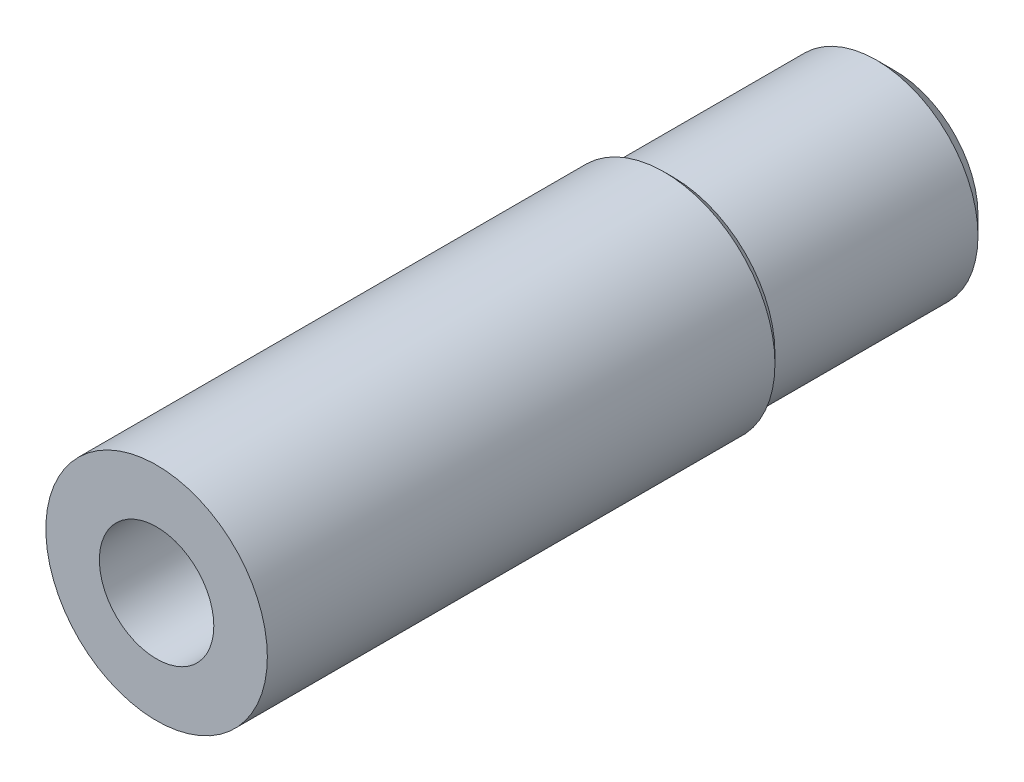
ISO-10303-21;
HEADER;
FILE_DESCRIPTION(('STEP AP214'),'2;1');
FILE_NAME('part.step','',(''),(''),'','','');
FILE_SCHEMA(('AUTOMOTIVE_DESIGN { 1 0 10303 214 1 1 1 1 }'));
ENDSEC;
DATA;
#1=APPLICATION_CONTEXT('core data for automotive mechanical design processes');
#2=APPLICATION_PROTOCOL_DEFINITION('international standard','automotive_design',2000,#1);
#3=PRODUCT_CONTEXT('',#1,'mechanical');
#4=PRODUCT('Part','Part','',(#3));
#5=PRODUCT_RELATED_PRODUCT_CATEGORY('part','',(#4));
#6=PRODUCT_DEFINITION_FORMATION('','',#4);
#7=PRODUCT_DEFINITION_CONTEXT('part definition',#1,'design');
#8=PRODUCT_DEFINITION('design','',#6,#7);
#9=PRODUCT_DEFINITION_SHAPE('','',#8);
#10=(LENGTH_UNIT() NAMED_UNIT(*) SI_UNIT(.MILLI.,.METRE.));
#11=(NAMED_UNIT(*) PLANE_ANGLE_UNIT() SI_UNIT($,.RADIAN.));
#12=(NAMED_UNIT(*) SI_UNIT($,.STERADIAN.) SOLID_ANGLE_UNIT());
#13=UNCERTAINTY_MEASURE_WITH_UNIT(LENGTH_MEASURE(1.E-05),#10,'distance_accuracy_value','');
#14=(GEOMETRIC_REPRESENTATION_CONTEXT(3) GLOBAL_UNCERTAINTY_ASSIGNED_CONTEXT((#13)) GLOBAL_UNIT_ASSIGNED_CONTEXT((#10,
#11,#12)) REPRESENTATION_CONTEXT('',''));
#15=CARTESIAN_POINT('',(0.,0.,0.));
#16=DIRECTION('',(0.,0.,1.));
#17=DIRECTION('',(1.,0.,0.));
#18=AXIS2_PLACEMENT_3D('',#15,#16,#17);
#19=CARTESIAN_POINT('',(1.00000000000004,0.,-13.));
#20=DIRECTION('',(0.,0.,-1.));
#21=DIRECTION('',(-1.,0.,0.));
#22=AXIS2_PLACEMENT_3D('',#19,#20,#21);
#23=PLANE('',#22);
#24=CARTESIAN_POINT('',(0.,0.,-13.));
#25=DIRECTION('',(0.,0.,1.));
#26=DIRECTION('',(1.,0.,0.));
#27=AXIS2_PLACEMENT_3D('',#24,#25,#26);
#28=CIRCLE('',#27,0.800799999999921);
#29=CARTESIAN_POINT('',(0.800800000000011,0.,-13.));
#30=VERTEX_POINT('',#29);
#31=EDGE_CURVE('E54',#30,#30,#28,.T.);
#32=ORIENTED_EDGE('',*,*,#31,.T.);
#33=EDGE_LOOP('',(#32));
#34=FACE_BOUND('',#33,.T.);
#35=CARTESIAN_POINT('',(0.,0.,-13.));
#36=DIRECTION('',(0.,0.,1.));
#37=DIRECTION('',(1.,0.,0.));
#38=AXIS2_PLACEMENT_3D('',#35,#36,#37);
#39=CIRCLE('',#38,1.24999999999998);
#40=CARTESIAN_POINT('',(1.25000000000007,0.,-13.));
#41=VERTEX_POINT('',#40);
#42=EDGE_CURVE('E17',#41,#41,#39,.F.);
#43=ORIENTED_EDGE('',*,*,#42,.T.);
#44=EDGE_LOOP('',(#43));
#45=FACE_BOUND('',#44,.T.);
#46=ADVANCED_FACE('F14',(#34,#45),#23,.T.);
#47=CARTESIAN_POINT('',(0.,0.,-16.5));
#48=DIRECTION('',(0.,0.,1.));
#49=DIRECTION('',(1.,0.,0.));
#50=AXIS2_PLACEMENT_3D('',#47,#48,#49);
#51=CYLINDRICAL_SURFACE('',#50,1.24999999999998);
#52=CARTESIAN_POINT('',(0.,0.,-20.));
#53=DIRECTION('',(0.,0.,1.));
#54=DIRECTION('',(1.,0.,0.));
#55=AXIS2_PLACEMENT_3D('',#52,#53,#54);
#56=CIRCLE('',#55,1.24999999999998);
#57=CARTESIAN_POINT('',(1.25000000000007,0.,-20.));
#58=VERTEX_POINT('',#57);
#59=EDGE_CURVE('E52',#58,#58,#56,.T.);
#60=ORIENTED_EDGE('',*,*,#59,.F.);
#61=EDGE_LOOP('',(#60));
#62=FACE_BOUND('',#61,.T.);
#63=ORIENTED_EDGE('',*,*,#42,.F.);
#64=EDGE_LOOP('',(#63));
#65=FACE_BOUND('',#64,.T.);
#66=ADVANCED_FACE('F62',(#62,#65),#51,.F.);
#67=CARTESIAN_POINT('',(0.,0.,-11.75));
#68=DIRECTION('',(0.,0.,1.));
#69=DIRECTION('',(1.,0.,0.));
#70=AXIS2_PLACEMENT_3D('',#67,#68,#69);
#71=CYLINDRICAL_SURFACE('',#70,0.800799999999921);
#72=ORIENTED_EDGE('',*,*,#31,.F.);
#73=EDGE_LOOP('',(#72));
#74=FACE_BOUND('',#73,.T.);
#75=CARTESIAN_POINT('',(0.,0.,-10.5));
#76=DIRECTION('',(0.,0.,1.));
#77=DIRECTION('',(1.,0.,0.));
#78=AXIS2_PLACEMENT_3D('',#75,#76,#77);
#79=CIRCLE('',#78,0.800799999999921);
#80=CARTESIAN_POINT('',(0.800800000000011,0.,-10.5));
#81=VERTEX_POINT('',#80);
#82=EDGE_CURVE('E49',#81,#81,#79,.F.);
#83=ORIENTED_EDGE('',*,*,#82,.F.);
#84=EDGE_LOOP('',(#83));
#85=FACE_BOUND('',#84,.T.);
#86=ADVANCED_FACE('F64',(#74,#85),#71,.F.);
#87=CARTESIAN_POINT('',(1.75000000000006,0.,-20.));
#88=DIRECTION('',(0.,0.,-1.));
#89=DIRECTION('',(-1.,0.,0.));
#90=AXIS2_PLACEMENT_3D('',#87,#88,#89);
#91=PLANE('',#90);
#92=ORIENTED_EDGE('',*,*,#59,.T.);
#93=EDGE_LOOP('',(#92));
#94=FACE_BOUND('',#93,.T.);
#95=CARTESIAN_POINT('',(0.,0.,-20.0000000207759));
#96=DIRECTION('',(0.,0.,1.));
#97=DIRECTION('',(1.,0.,0.));
#98=AXIS2_PLACEMENT_3D('',#95,#96,#97);
#99=CIRCLE('',#98,2.25000002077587);
#100=CARTESIAN_POINT('',(2.25000002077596,0.,-20.0000000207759));
#101=VERTEX_POINT('',#100);
#102=EDGE_CURVE('E46',#101,#101,#99,.T.);
#103=ORIENTED_EDGE('',*,*,#102,.F.);
#104=EDGE_LOOP('',(#103));
#105=FACE_BOUND('',#104,.T.);
#106=ADVANCED_FACE('F72',(#94,#105),#91,.T.);
#107=CARTESIAN_POINT('',(1.15,0.,-10.5));
#108=DIRECTION('',(0.,0.,1.));
#109=DIRECTION('',(1.,0.,0.));
#110=AXIS2_PLACEMENT_3D('',#107,#108,#109);
#111=PLANE('',#110);
#112=ORIENTED_EDGE('',*,*,#82,.T.);
#113=EDGE_LOOP('',(#112));
#114=FACE_BOUND('',#113,.T.);
#115=CARTESIAN_POINT('',(0.,0.,-10.5));
#116=DIRECTION('',(0.,0.,1.));
#117=DIRECTION('',(1.,0.,0.));
#118=AXIS2_PLACEMENT_3D('',#115,#116,#117);
#119=CIRCLE('',#118,1.54999999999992);
#120=CARTESIAN_POINT('',(1.55000000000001,0.,-10.5));
#121=VERTEX_POINT('',#120);
#122=EDGE_CURVE('E39',#121,#121,#119,.T.);
#123=ORIENTED_EDGE('',*,*,#122,.T.);
#124=EDGE_LOOP('',(#123));
#125=FACE_BOUND('',#124,.T.);
#126=ADVANCED_FACE('F103',(#114,#125),#111,.T.);
#127=CARTESIAN_POINT('',(0.,0.,-19.5000000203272));
#128=DIRECTION('',(0.,0.,1.));
#129=DIRECTION('',(1.,0.,0.));
#130=AXIS2_PLACEMENT_3D('',#127,#128,#129);
#131=CONICAL_SURFACE('',#130,2.75000002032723,0.785398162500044);
#132=ORIENTED_EDGE('',*,*,#102,.T.);
#133=EDGE_LOOP('',(#132));
#134=FACE_BOUND('',#133,.T.);
#135=CARTESIAN_POINT('',(0.,0.,-19.5));
#136=DIRECTION('',(0.,0.,1.));
#137=DIRECTION('',(1.,0.,0.));
#138=AXIS2_PLACEMENT_3D('',#135,#136,#137);
#139=CIRCLE('',#138,2.75);
#140=CARTESIAN_POINT('',(2.75000000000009,0.,-19.5));
#141=VERTEX_POINT('',#140);
#142=EDGE_CURVE('E36',#141,#141,#139,.T.);
#143=ORIENTED_EDGE('',*,*,#142,.F.);
#144=EDGE_LOOP('',(#143));
#145=FACE_BOUND('',#144,.T.);
#146=ADVANCED_FACE('F99',(#134,#145),#131,.T.);
#147=CARTESIAN_POINT('',(0.,0.,-5.25));
#148=DIRECTION('',(0.,0.,1.));
#149=DIRECTION('',(1.,0.,0.));
#150=AXIS2_PLACEMENT_3D('',#147,#148,#149);
#151=CYLINDRICAL_SURFACE('',#150,1.54999999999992);
#152=ORIENTED_EDGE('',*,*,#122,.F.);
#153=EDGE_LOOP('',(#152));
#154=FACE_BOUND('',#153,.T.);
#155=CARTESIAN_POINT('',(0.,0.,0.));
#156=DIRECTION('',(0.,0.,1.));
#157=DIRECTION('',(1.,0.,0.));
#158=AXIS2_PLACEMENT_3D('',#155,#156,#157);
#159=CIRCLE('',#158,1.54999999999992);
#160=CARTESIAN_POINT('',(1.55000000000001,0.,0.));
#161=VERTEX_POINT('',#160);
#162=EDGE_CURVE('E33',#161,#161,#159,.F.);
#163=ORIENTED_EDGE('',*,*,#162,.F.);
#164=EDGE_LOOP('',(#163));
#165=FACE_BOUND('',#164,.T.);
#166=ADVANCED_FACE('F95',(#154,#165),#151,.F.);
#167=CARTESIAN_POINT('',(0.,0.,-16.75));
#168=DIRECTION('',(0.,0.,1.));
#169=DIRECTION('',(1.,0.,0.));
#170=AXIS2_PLACEMENT_3D('',#167,#168,#169);
#171=CYLINDRICAL_SURFACE('',#170,2.75);
#172=ORIENTED_EDGE('',*,*,#142,.T.);
#173=EDGE_LOOP('',(#172));
#174=FACE_BOUND('',#173,.T.);
#175=CARTESIAN_POINT('',(0.,0.,-14.0000000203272));
#176=DIRECTION('',(0.,0.,1.));
#177=DIRECTION('',(1.,0.,0.));
#178=AXIS2_PLACEMENT_3D('',#175,#176,#177);
#179=CIRCLE('',#178,2.75000002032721);
#180=CARTESIAN_POINT('',(2.7500000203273,0.,-14.0000000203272));
#181=VERTEX_POINT('',#180);
#182=EDGE_CURVE('E26',#181,#181,#179,.T.);
#183=ORIENTED_EDGE('',*,*,#182,.F.);
#184=EDGE_LOOP('',(#183));
#185=FACE_BOUND('',#184,.T.);
#186=ADVANCED_FACE('F91',(#174,#185),#171,.T.);
#187=CARTESIAN_POINT('',(2.27499999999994,0.,0.));
#188=DIRECTION('',(0.,0.,1.));
#189=DIRECTION('',(1.,0.,0.));
#190=AXIS2_PLACEMENT_3D('',#187,#188,#189);
#191=PLANE('',#190);
#192=CARTESIAN_POINT('',(0.,0.,0.));
#193=DIRECTION('',(0.,0.,1.));
#194=DIRECTION('',(1.,0.,0.));
#195=AXIS2_PLACEMENT_3D('',#192,#193,#194);
#196=CIRCLE('',#195,2.99999999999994);
#197=CARTESIAN_POINT('',(3.00000000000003,0.,0.));
#198=VERTEX_POINT('',#197);
#199=EDGE_CURVE('E21',#198,#198,#196,.F.);
#200=ORIENTED_EDGE('',*,*,#199,.F.);
#201=EDGE_LOOP('',(#200));
#202=FACE_BOUND('',#201,.T.);
#203=ORIENTED_EDGE('',*,*,#162,.T.);
#204=EDGE_LOOP('',(#203));
#205=FACE_BOUND('',#204,.T.);
#206=ADVANCED_FACE('F84',(#202,#205),#191,.T.);
#207=CARTESIAN_POINT('',(0.,0.,-13.7500000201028));
#208=DIRECTION('',(0.,0.,1.));
#209=DIRECTION('',(0.,-1.,0.));
#210=AXIS2_PLACEMENT_3D('',#207,#208,#209);
#211=CONICAL_SURFACE('',#210,3.00000002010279,0.785398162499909);
#212=ORIENTED_EDGE('',*,*,#182,.T.);
#213=EDGE_LOOP('',(#212));
#214=FACE_BOUND('',#213,.T.);
#215=CARTESIAN_POINT('',(0.,0.,-13.75));
#216=DIRECTION('',(0.,0.,1.));
#217=DIRECTION('',(1.,0.,0.));
#218=AXIS2_PLACEMENT_3D('',#215,#216,#217);
#219=CIRCLE('',#218,2.99999999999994);
#220=CARTESIAN_POINT('',(3.00000000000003,0.,-13.75));
#221=VERTEX_POINT('',#220);
#222=EDGE_CURVE('E9',#221,#221,#219,.T.);
#223=ORIENTED_EDGE('',*,*,#222,.F.);
#224=EDGE_LOOP('',(#223));
#225=FACE_BOUND('',#224,.T.);
#226=ADVANCED_FACE('F78',(#214,#225),#211,.T.);
#227=CARTESIAN_POINT('',(0.,0.,-6.875));
#228=DIRECTION('',(0.,0.,1.));
#229=DIRECTION('',(1.,0.,0.));
#230=AXIS2_PLACEMENT_3D('',#227,#228,#229);
#231=CYLINDRICAL_SURFACE('',#230,2.99999999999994);
#232=ORIENTED_EDGE('',*,*,#222,.T.);
#233=EDGE_LOOP('',(#232));
#234=FACE_BOUND('',#233,.T.);
#235=ORIENTED_EDGE('',*,*,#199,.T.);
#236=EDGE_LOOP('',(#235));
#237=FACE_BOUND('',#236,.T.);
#238=ADVANCED_FACE('F76',(#234,#237),#231,.T.);
#239=CLOSED_SHELL('',(#46,#66,#86,#106,#126,#146,#166,#186,#206,#226,#238));
#240=MANIFOLD_SOLID_BREP('B1',#239);
#241=ADVANCED_BREP_SHAPE_REPRESENTATION('',(#18,#240),#14);
#242=SHAPE_DEFINITION_REPRESENTATION(#9,#241);
ENDSEC;
END-ISO-10303-21;
